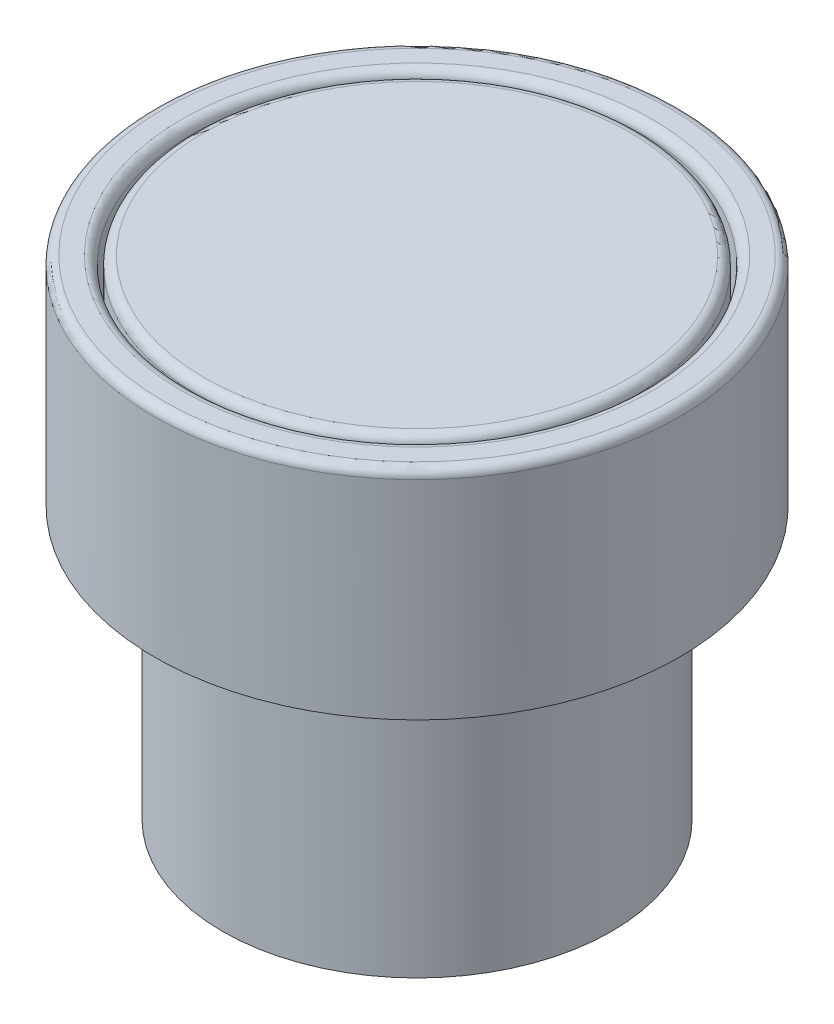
ISO-10303-21;
HEADER;
FILE_DESCRIPTION(('STEP AP214'),'2;1');
FILE_NAME('part.step','',(''),(''),'','','');
FILE_SCHEMA(('AUTOMOTIVE_DESIGN { 1 0 10303 214 1 1 1 1 }'));
ENDSEC;
DATA;
#1=APPLICATION_CONTEXT('core data for automotive mechanical design processes');
#2=APPLICATION_PROTOCOL_DEFINITION('international standard','automotive_design',2000,#1);
#3=PRODUCT_CONTEXT('',#1,'mechanical');
#4=PRODUCT('Part','Part','',(#3));
#5=PRODUCT_RELATED_PRODUCT_CATEGORY('part','',(#4));
#6=PRODUCT_DEFINITION_FORMATION('','',#4);
#7=PRODUCT_DEFINITION_CONTEXT('part definition',#1,'design');
#8=PRODUCT_DEFINITION('design','',#6,#7);
#9=PRODUCT_DEFINITION_SHAPE('','',#8);
#10=(LENGTH_UNIT() NAMED_UNIT(*) SI_UNIT(.MILLI.,.METRE.));
#11=(NAMED_UNIT(*) PLANE_ANGLE_UNIT() SI_UNIT($,.RADIAN.));
#12=(NAMED_UNIT(*) SI_UNIT($,.STERADIAN.) SOLID_ANGLE_UNIT());
#13=UNCERTAINTY_MEASURE_WITH_UNIT(LENGTH_MEASURE(1.E-05),#10,'distance_accuracy_value','');
#14=(GEOMETRIC_REPRESENTATION_CONTEXT(3) GLOBAL_UNCERTAINTY_ASSIGNED_CONTEXT((#13)) GLOBAL_UNIT_ASSIGNED_CONTEXT((#10,
#11,#12)) REPRESENTATION_CONTEXT('',''));
#15=CARTESIAN_POINT('',(0.,0.,0.));
#16=DIRECTION('',(0.,0.,1.));
#17=DIRECTION('',(1.,0.,0.));
#18=AXIS2_PLACEMENT_3D('',#15,#16,#17);
#19=CARTESIAN_POINT('',(0.,0.,0.));
#20=DIRECTION('',(0.,-1.,0.));
#21=DIRECTION('',(0.,0.,-1.));
#22=AXIS2_PLACEMENT_3D('',#19,#20,#21);
#23=PLANE('',#22);
#24=CARTESIAN_POINT('',(0.,0.,0.));
#25=DIRECTION('',(0.,1.,0.));
#26=DIRECTION('',(0.,0.,1.));
#27=AXIS2_PLACEMENT_3D('',#24,#25,#26);
#28=CIRCLE('',#27,12.5);
#29=CARTESIAN_POINT('',(0.,0.,12.5));
#30=VERTEX_POINT('',#29);
#31=EDGE_CURVE('E70',#30,#30,#28,.T.);
#32=ORIENTED_EDGE('',*,*,#31,.T.);
#33=EDGE_LOOP('',(#32));
#34=FACE_BOUND('',#33,.T.);
#35=CARTESIAN_POINT('',(0.,0.,0.));
#36=DIRECTION('',(0.,-1.,0.));
#37=DIRECTION('',(0.,0.,-1.));
#38=AXIS2_PLACEMENT_3D('',#35,#36,#37);
#39=CIRCLE('',#38,12.25);
#40=CARTESIAN_POINT('',(0.,0.,-12.25));
#41=VERTEX_POINT('',#40);
#42=EDGE_CURVE('E67',#41,#41,#39,.F.);
#43=ORIENTED_EDGE('',*,*,#42,.F.);
#44=EDGE_LOOP('',(#43));
#45=FACE_BOUND('',#44,.T.);
#46=ADVANCED_FACE('F41',(#34,#45),#23,.F.);
#47=CARTESIAN_POINT('',(0.,-1.,0.));
#48=DIRECTION('',(0.,-1.,0.));
#49=DIRECTION('',(0.,0.,-1.));
#50=AXIS2_PLACEMENT_3D('',#47,#48,#49);
#51=PLANE('',#50);
#52=CARTESIAN_POINT('',(0.,-1.,0.));
#53=DIRECTION('',(0.,-1.,0.));
#54=DIRECTION('',(0.,0.,-1.));
#55=AXIS2_PLACEMENT_3D('',#52,#53,#54);
#56=CIRCLE('',#55,14.5);
#57=CARTESIAN_POINT('',(0.,-1.,-14.5));
#58=VERTEX_POINT('',#57);
#59=EDGE_CURVE('E73',#58,#58,#56,.T.);
#60=ORIENTED_EDGE('',*,*,#59,.T.);
#61=EDGE_LOOP('',(#60));
#62=FACE_BOUND('',#61,.T.);
#63=CARTESIAN_POINT('',(0.,-1.,0.));
#64=DIRECTION('',(0.,-1.,0.));
#65=DIRECTION('',(0.,0.,-1.));
#66=AXIS2_PLACEMENT_3D('',#63,#64,#65);
#67=CIRCLE('',#66,10.75);
#68=CARTESIAN_POINT('',(0.,-1.,-10.75));
#69=VERTEX_POINT('',#68);
#70=EDGE_CURVE('E77',#69,#69,#67,.T.);
#71=ORIENTED_EDGE('',*,*,#70,.F.);
#72=EDGE_LOOP('',(#71));
#73=FACE_BOUND('',#72,.T.);
#74=ADVANCED_FACE('F92',(#62,#73),#51,.T.);
#75=CARTESIAN_POINT('',(0.,11.,0.));
#76=DIRECTION('',(0.,1.,0.));
#77=DIRECTION('',(0.,0.,1.));
#78=AXIS2_PLACEMENT_3D('',#75,#76,#77);
#79=PLANE('',#78);
#80=CARTESIAN_POINT('',(0.,11.,0.));
#81=DIRECTION('',(0.,1.,0.));
#82=DIRECTION('',(0.,0.,1.));
#83=AXIS2_PLACEMENT_3D('',#80,#81,#82);
#84=CIRCLE('',#83,14.);
#85=CARTESIAN_POINT('',(0.,11.,14.));
#86=VERTEX_POINT('',#85);
#87=EDGE_CURVE('E52',#86,#86,#84,.T.);
#88=ORIENTED_EDGE('',*,*,#87,.T.);
#89=EDGE_LOOP('',(#88));
#90=FACE_BOUND('',#89,.T.);
#91=CARTESIAN_POINT('',(0.,11.,0.));
#92=DIRECTION('',(0.,1.,0.));
#93=DIRECTION('',(0.,0.,1.));
#94=AXIS2_PLACEMENT_3D('',#91,#92,#93);
#95=CIRCLE('',#94,13.);
#96=CARTESIAN_POINT('',(0.,11.,13.));
#97=VERTEX_POINT('',#96);
#98=EDGE_CURVE('E56',#97,#97,#95,.F.);
#99=ORIENTED_EDGE('',*,*,#98,.T.);
#100=EDGE_LOOP('',(#99));
#101=FACE_BOUND('',#100,.T.);
#102=ADVANCED_FACE('F94',(#90,#101),#79,.T.);
#103=CARTESIAN_POINT('',(0.,11.,0.));
#104=DIRECTION('',(0.,-1.,0.));
#105=DIRECTION('',(0.,0.,-1.));
#106=AXIS2_PLACEMENT_3D('',#103,#104,#105);
#107=CYLINDRICAL_SURFACE('',#106,14.5);
#108=CARTESIAN_POINT('',(0.,10.5,0.));
#109=DIRECTION('',(0.,1.,0.));
#110=DIRECTION('',(0.,0.,1.));
#111=AXIS2_PLACEMENT_3D('',#108,#109,#110);
#112=CIRCLE('',#111,14.5);
#113=CARTESIAN_POINT('',(0.,10.5,14.5));
#114=VERTEX_POINT('',#113);
#115=EDGE_CURVE('E48',#114,#114,#112,.F.);
#116=ORIENTED_EDGE('',*,*,#115,.T.);
#117=EDGE_LOOP('',(#116));
#118=FACE_BOUND('',#117,.T.);
#119=ORIENTED_EDGE('',*,*,#59,.F.);
#120=EDGE_LOOP('',(#119));
#121=FACE_BOUND('',#120,.T.);
#122=ADVANCED_FACE('F100',(#118,#121),#107,.T.);
#123=CARTESIAN_POINT('',(0.,11.,0.));
#124=DIRECTION('',(0.,-1.,0.));
#125=DIRECTION('',(0.,0.,-1.));
#126=AXIS2_PLACEMENT_3D('',#123,#124,#125);
#127=CYLINDRICAL_SURFACE('',#126,12.5);
#128=CARTESIAN_POINT('',(0.,10.5,0.));
#129=DIRECTION('',(0.,1.,0.));
#130=DIRECTION('',(0.,0.,1.));
#131=AXIS2_PLACEMENT_3D('',#128,#129,#130);
#132=CIRCLE('',#131,12.5);
#133=CARTESIAN_POINT('',(0.,10.5,12.5));
#134=VERTEX_POINT('',#133);
#135=EDGE_CURVE('E10',#134,#134,#132,.T.);
#136=ORIENTED_EDGE('',*,*,#135,.T.);
#137=EDGE_LOOP('',(#136));
#138=FACE_BOUND('',#137,.T.);
#139=ORIENTED_EDGE('',*,*,#31,.F.);
#140=EDGE_LOOP('',(#139));
#141=FACE_BOUND('',#140,.T.);
#142=ADVANCED_FACE('F88',(#138,#141),#127,.F.);
#143=CARTESIAN_POINT('',(0.,-16.,0.));
#144=DIRECTION('',(0.,1.,0.));
#145=DIRECTION('',(0.,0.,1.));
#146=AXIS2_PLACEMENT_3D('',#143,#144,#145);
#147=CYLINDRICAL_SURFACE('',#146,10.75);
#148=CARTESIAN_POINT('',(0.,-16.,0.));
#149=DIRECTION('',(0.,-1.,0.));
#150=DIRECTION('',(0.,0.,-1.));
#151=AXIS2_PLACEMENT_3D('',#148,#149,#150);
#152=CIRCLE('',#151,10.75);
#153=CARTESIAN_POINT('',(0.,-16.,-10.75));
#154=VERTEX_POINT('',#153);
#155=EDGE_CURVE('E76',#154,#154,#152,.T.);
#156=ORIENTED_EDGE('',*,*,#155,.F.);
#157=EDGE_LOOP('',(#156));
#158=FACE_BOUND('',#157,.T.);
#159=ORIENTED_EDGE('',*,*,#70,.T.);
#160=EDGE_LOOP('',(#159));
#161=FACE_BOUND('',#160,.T.);
#162=ADVANCED_FACE('F85',(#158,#161),#147,.T.);
#163=CARTESIAN_POINT('',(0.,-16.,0.));
#164=DIRECTION('',(0.,-1.,0.));
#165=DIRECTION('',(0.,0.,-1.));
#166=AXIS2_PLACEMENT_3D('',#163,#164,#165);
#167=PLANE('',#166);
#168=ORIENTED_EDGE('',*,*,#155,.T.);
#169=EDGE_LOOP('',(#168));
#170=FACE_BOUND('',#169,.T.);
#171=ADVANCED_FACE('F83',(#170),#167,.T.);
#172=CARTESIAN_POINT('',(0.,45.6482322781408,0.));
#173=DIRECTION('',(0.,-1.,0.));
#174=DIRECTION('',(0.,0.,-1.));
#175=AXIS2_PLACEMENT_3D('',#172,#173,#174);
#176=CYLINDRICAL_SURFACE('',#175,12.25);
#177=CARTESIAN_POINT('',(0.,10.5,0.));
#178=DIRECTION('',(0.,1.,0.));
#179=DIRECTION('',(0.,0.,1.));
#180=AXIS2_PLACEMENT_3D('',#177,#178,#179);
#181=CIRCLE('',#180,12.25);
#182=CARTESIAN_POINT('',(0.,10.5,12.25));
#183=VERTEX_POINT('',#182);
#184=EDGE_CURVE('E61',#183,#183,#181,.F.);
#185=ORIENTED_EDGE('',*,*,#184,.T.);
#186=EDGE_LOOP('',(#185));
#187=FACE_BOUND('',#186,.T.);
#188=ORIENTED_EDGE('',*,*,#42,.T.);
#189=EDGE_LOOP('',(#188));
#190=FACE_BOUND('',#189,.T.);
#191=ADVANCED_FACE('F146',(#187,#190),#176,.T.);
#192=CARTESIAN_POINT('',(0.,11.,0.));
#193=DIRECTION('',(0.,1.,0.));
#194=DIRECTION('',(0.,0.,1.));
#195=AXIS2_PLACEMENT_3D('',#192,#193,#194);
#196=PLANE('',#195);
#197=CARTESIAN_POINT('',(0.,11.,0.));
#198=DIRECTION('',(0.,1.,0.));
#199=DIRECTION('',(0.,0.,1.));
#200=AXIS2_PLACEMENT_3D('',#197,#198,#199);
#201=CIRCLE('',#200,11.75);
#202=CARTESIAN_POINT('',(0.,11.,11.75));
#203=VERTEX_POINT('',#202);
#204=EDGE_CURVE('E64',#203,#203,#201,.T.);
#205=ORIENTED_EDGE('',*,*,#204,.T.);
#206=EDGE_LOOP('',(#205));
#207=FACE_BOUND('',#206,.T.);
#208=ADVANCED_FACE('F115',(#207),#196,.T.);
#209=CARTESIAN_POINT('',(0.,10.5,0.));
#210=DIRECTION('',(0.,1.,0.));
#211=DIRECTION('',(0.,0.,1.));
#212=AXIS2_PLACEMENT_3D('',#209,#210,#211);
#213=TOROIDAL_SURFACE('',#212,11.75,0.5);
#214=ORIENTED_EDGE('',*,*,#184,.F.);
#215=EDGE_LOOP('',(#214));
#216=FACE_BOUND('',#215,.T.);
#217=ORIENTED_EDGE('',*,*,#204,.F.);
#218=EDGE_LOOP('',(#217));
#219=FACE_BOUND('',#218,.T.);
#220=ADVANCED_FACE('F112',(#216,#219),#213,.T.);
#221=CARTESIAN_POINT('',(0.,10.5,0.));
#222=DIRECTION('',(0.,1.,0.));
#223=DIRECTION('',(0.,0.,1.));
#224=AXIS2_PLACEMENT_3D('',#221,#222,#223);
#225=TOROIDAL_SURFACE('',#224,14.,0.5);
#226=ORIENTED_EDGE('',*,*,#115,.F.);
#227=EDGE_LOOP('',(#226));
#228=FACE_BOUND('',#227,.T.);
#229=ORIENTED_EDGE('',*,*,#87,.F.);
#230=EDGE_LOOP('',(#229));
#231=FACE_BOUND('',#230,.T.);
#232=ADVANCED_FACE('F114',(#228,#231),#225,.T.);
#233=CARTESIAN_POINT('',(0.,10.5,0.));
#234=DIRECTION('',(0.,1.,0.));
#235=DIRECTION('',(0.,0.,1.));
#236=AXIS2_PLACEMENT_3D('',#233,#234,#235);
#237=TOROIDAL_SURFACE('',#236,13.,0.5);
#238=ORIENTED_EDGE('',*,*,#98,.F.);
#239=EDGE_LOOP('',(#238));
#240=FACE_BOUND('',#239,.T.);
#241=ORIENTED_EDGE('',*,*,#135,.F.);
#242=EDGE_LOOP('',(#241));
#243=FACE_BOUND('',#242,.T.);
#244=ADVANCED_FACE('F43',(#240,#243),#237,.T.);
#245=CLOSED_SHELL('',(#46,#74,#102,#122,#142,#162,#171,#191,#208,#220,#232,#244));
#246=MANIFOLD_SOLID_BREP('B2',#245);
#247=ADVANCED_BREP_SHAPE_REPRESENTATION('',(#18,#246),#14);
#248=SHAPE_DEFINITION_REPRESENTATION(#9,#247);
ENDSEC;
END-ISO-10303-21;
